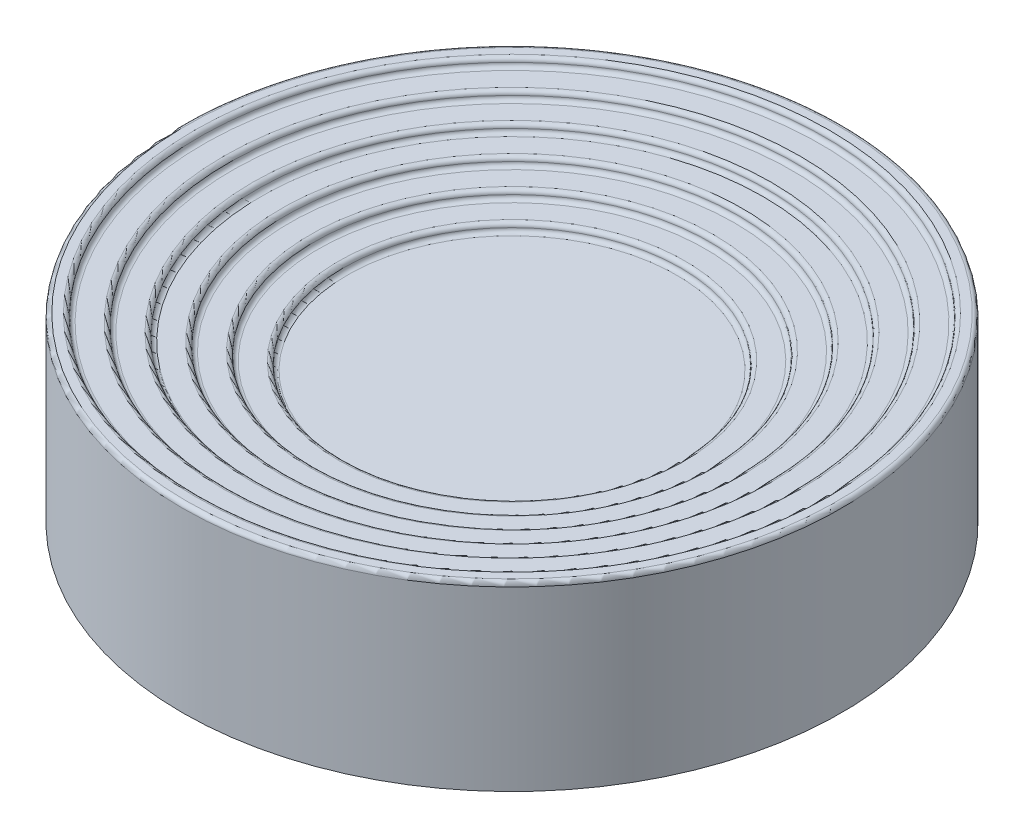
ISO-10303-21;
HEADER;
FILE_DESCRIPTION(('STEP AP214'),'2;1');
FILE_NAME('part.step','',(''),(''),'','','');
FILE_SCHEMA(('AUTOMOTIVE_DESIGN { 1 0 10303 214 1 1 1 1 }'));
ENDSEC;
DATA;
#1=APPLICATION_CONTEXT('core data for automotive mechanical design processes');
#2=APPLICATION_PROTOCOL_DEFINITION('international standard','automotive_design',2000,#1);
#3=PRODUCT_CONTEXT('',#1,'mechanical');
#4=PRODUCT('Part','Part','',(#3));
#5=PRODUCT_RELATED_PRODUCT_CATEGORY('part','',(#4));
#6=PRODUCT_DEFINITION_FORMATION('','',#4);
#7=PRODUCT_DEFINITION_CONTEXT('part definition',#1,'design');
#8=PRODUCT_DEFINITION('design','',#6,#7);
#9=PRODUCT_DEFINITION_SHAPE('','',#8);
#10=(LENGTH_UNIT() NAMED_UNIT(*) SI_UNIT(.MILLI.,.METRE.));
#11=(NAMED_UNIT(*) PLANE_ANGLE_UNIT() SI_UNIT($,.RADIAN.));
#12=(NAMED_UNIT(*) SI_UNIT($,.STERADIAN.) SOLID_ANGLE_UNIT());
#13=UNCERTAINTY_MEASURE_WITH_UNIT(LENGTH_MEASURE(1.E-05),#10,'distance_accuracy_value','');
#14=(GEOMETRIC_REPRESENTATION_CONTEXT(3) GLOBAL_UNCERTAINTY_ASSIGNED_CONTEXT((#13)) GLOBAL_UNIT_ASSIGNED_CONTEXT((#10,
#11,#12)) REPRESENTATION_CONTEXT('',''));
#15=CARTESIAN_POINT('',(0.,0.,0.));
#16=DIRECTION('',(0.,0.,1.));
#17=DIRECTION('',(1.,0.,0.));
#18=AXIS2_PLACEMENT_3D('',#15,#16,#17);
#19=CARTESIAN_POINT('',(0.,32.,0.));
#20=DIRECTION('',(0.,1.,0.));
#21=DIRECTION('',(0.,0.,1.));
#22=AXIS2_PLACEMENT_3D('',#19,#20,#21);
#23=PLANE('',#22);
#24=CARTESIAN_POINT('',(0.,32.,0.));
#25=DIRECTION('',(0.,1.,0.));
#26=DIRECTION('',(0.,0.,1.));
#27=AXIS2_PLACEMENT_3D('',#24,#25,#26);
#28=CIRCLE('',#27,40.);
#29=CARTESIAN_POINT('',(0.,32.,40.));
#30=VERTEX_POINT('',#29);
#31=EDGE_CURVE('E100',#30,#30,#28,.T.);
#32=ORIENTED_EDGE('',*,*,#31,.T.);
#33=EDGE_LOOP('',(#32));
#34=FACE_BOUND('',#33,.T.);
#35=ADVANCED_FACE('F42',(#34),#23,.T.);
#36=CARTESIAN_POINT('',(41.,34.,0.));
#37=DIRECTION('',(0.,1.,0.));
#38=DIRECTION('',(0.,0.,1.));
#39=AXIS2_PLACEMENT_3D('',#36,#37,#38);
#40=PLANE('',#39);
#41=CARTESIAN_POINT('',(0.,34.,0.));
#42=DIRECTION('',(0.,1.,0.));
#43=DIRECTION('',(0.,0.,1.));
#44=AXIS2_PLACEMENT_3D('',#41,#42,#43);
#45=CIRCLE('',#44,42.);
#46=CARTESIAN_POINT('',(0.,34.,42.));
#47=VERTEX_POINT('',#46);
#48=EDGE_CURVE('E108',#47,#47,#45,.F.);
#49=ORIENTED_EDGE('',*,*,#48,.T.);
#50=EDGE_LOOP('',(#49));
#51=FACE_BOUND('',#50,.T.);
#52=CARTESIAN_POINT('',(0.,34.,0.));
#53=DIRECTION('',(0.,1.,0.));
#54=DIRECTION('',(0.,0.,1.));
#55=AXIS2_PLACEMENT_3D('',#52,#53,#54);
#56=CIRCLE('',#55,47.);
#57=CARTESIAN_POINT('',(0.,34.,47.));
#58=VERTEX_POINT('',#57);
#59=EDGE_CURVE('E104',#58,#58,#56,.T.);
#60=ORIENTED_EDGE('',*,*,#59,.T.);
#61=EDGE_LOOP('',(#60));
#62=FACE_BOUND('',#61,.T.);
#63=ADVANCED_FACE('F165',(#51,#62),#40,.T.);
#64=CARTESIAN_POINT('',(48.,36.,0.));
#65=DIRECTION('',(0.,1.,0.));
#66=DIRECTION('',(0.,0.,1.));
#67=AXIS2_PLACEMENT_3D('',#64,#65,#66);
#68=PLANE('',#67);
#69=CARTESIAN_POINT('',(0.,36.,0.));
#70=DIRECTION('',(0.,1.,0.));
#71=DIRECTION('',(0.,0.,1.));
#72=AXIS2_PLACEMENT_3D('',#69,#70,#71);
#73=CIRCLE('',#72,49.);
#74=CARTESIAN_POINT('',(0.,36.,49.));
#75=VERTEX_POINT('',#74);
#76=EDGE_CURVE('E116',#75,#75,#73,.F.);
#77=ORIENTED_EDGE('',*,*,#76,.T.);
#78=EDGE_LOOP('',(#77));
#79=FACE_BOUND('',#78,.T.);
#80=CARTESIAN_POINT('',(0.,36.,0.));
#81=DIRECTION('',(0.,1.,0.));
#82=DIRECTION('',(0.,0.,1.));
#83=AXIS2_PLACEMENT_3D('',#80,#81,#82);
#84=CIRCLE('',#83,54.);
#85=CARTESIAN_POINT('',(0.,36.,54.));
#86=VERTEX_POINT('',#85);
#87=EDGE_CURVE('E112',#86,#86,#84,.T.);
#88=ORIENTED_EDGE('',*,*,#87,.T.);
#89=EDGE_LOOP('',(#88));
#90=FACE_BOUND('',#89,.T.);
#91=ADVANCED_FACE('F171',(#79,#90),#68,.T.);
#92=CARTESIAN_POINT('',(55.,38.,0.));
#93=DIRECTION('',(0.,1.,0.));
#94=DIRECTION('',(0.,0.,1.));
#95=AXIS2_PLACEMENT_3D('',#92,#93,#94);
#96=PLANE('',#95);
#97=CARTESIAN_POINT('',(0.,38.,0.));
#98=DIRECTION('',(0.,1.,0.));
#99=DIRECTION('',(0.,0.,1.));
#100=AXIS2_PLACEMENT_3D('',#97,#98,#99);
#101=CIRCLE('',#100,56.);
#102=CARTESIAN_POINT('',(0.,38.,56.));
#103=VERTEX_POINT('',#102);
#104=EDGE_CURVE('E124',#103,#103,#101,.F.);
#105=ORIENTED_EDGE('',*,*,#104,.T.);
#106=EDGE_LOOP('',(#105));
#107=FACE_BOUND('',#106,.T.);
#108=CARTESIAN_POINT('',(0.,38.,0.));
#109=DIRECTION('',(0.,1.,0.));
#110=DIRECTION('',(0.,0.,1.));
#111=AXIS2_PLACEMENT_3D('',#108,#109,#110);
#112=CIRCLE('',#111,61.);
#113=CARTESIAN_POINT('',(0.,38.,61.));
#114=VERTEX_POINT('',#113);
#115=EDGE_CURVE('E120',#114,#114,#112,.T.);
#116=ORIENTED_EDGE('',*,*,#115,.T.);
#117=EDGE_LOOP('',(#116));
#118=FACE_BOUND('',#117,.T.);
#119=ADVANCED_FACE('F239',(#107,#118),#96,.T.);
#120=CARTESIAN_POINT('',(62.,40.,0.));
#121=DIRECTION('',(0.,1.,0.));
#122=DIRECTION('',(0.,0.,1.));
#123=AXIS2_PLACEMENT_3D('',#120,#121,#122);
#124=PLANE('',#123);
#125=CARTESIAN_POINT('',(0.,40.,0.));
#126=DIRECTION('',(0.,1.,0.));
#127=DIRECTION('',(0.,0.,1.));
#128=AXIS2_PLACEMENT_3D('',#125,#126,#127);
#129=CIRCLE('',#128,63.);
#130=CARTESIAN_POINT('',(0.,40.,63.));
#131=VERTEX_POINT('',#130);
#132=EDGE_CURVE('E132',#131,#131,#129,.F.);
#133=ORIENTED_EDGE('',*,*,#132,.T.);
#134=EDGE_LOOP('',(#133));
#135=FACE_BOUND('',#134,.T.);
#136=CARTESIAN_POINT('',(0.,40.,0.));
#137=DIRECTION('',(0.,1.,0.));
#138=DIRECTION('',(0.,0.,1.));
#139=AXIS2_PLACEMENT_3D('',#136,#137,#138);
#140=CIRCLE('',#139,68.);
#141=CARTESIAN_POINT('',(0.,40.,68.));
#142=VERTEX_POINT('',#141);
#143=EDGE_CURVE('E128',#142,#142,#140,.T.);
#144=ORIENTED_EDGE('',*,*,#143,.T.);
#145=EDGE_LOOP('',(#144));
#146=FACE_BOUND('',#145,.T.);
#147=ADVANCED_FACE('F232',(#135,#146),#124,.T.);
#148=CARTESIAN_POINT('',(69.,42.,0.));
#149=DIRECTION('',(0.,1.,0.));
#150=DIRECTION('',(0.,0.,1.));
#151=AXIS2_PLACEMENT_3D('',#148,#149,#150);
#152=PLANE('',#151);
#153=CARTESIAN_POINT('',(0.,42.,0.));
#154=DIRECTION('',(0.,1.,0.));
#155=DIRECTION('',(0.,0.,1.));
#156=AXIS2_PLACEMENT_3D('',#153,#154,#155);
#157=CIRCLE('',#156,70.);
#158=CARTESIAN_POINT('',(0.,42.,70.));
#159=VERTEX_POINT('',#158);
#160=EDGE_CURVE('E140',#159,#159,#157,.F.);
#161=ORIENTED_EDGE('',*,*,#160,.T.);
#162=EDGE_LOOP('',(#161));
#163=FACE_BOUND('',#162,.T.);
#164=CARTESIAN_POINT('',(0.,42.,0.));
#165=DIRECTION('',(0.,1.,0.));
#166=DIRECTION('',(0.,0.,1.));
#167=AXIS2_PLACEMENT_3D('',#164,#165,#166);
#168=CIRCLE('',#167,75.);
#169=CARTESIAN_POINT('',(0.,42.,75.));
#170=VERTEX_POINT('',#169);
#171=EDGE_CURVE('E136',#170,#170,#168,.T.);
#172=ORIENTED_EDGE('',*,*,#171,.T.);
#173=EDGE_LOOP('',(#172));
#174=FACE_BOUND('',#173,.T.);
#175=ADVANCED_FACE('F225',(#163,#174),#152,.T.);
#176=CARTESIAN_POINT('',(80.,44.,0.));
#177=DIRECTION('',(0.,1.,0.));
#178=DIRECTION('',(0.,0.,1.));
#179=AXIS2_PLACEMENT_3D('',#176,#177,#178);
#180=PLANE('',#179);
#181=CARTESIAN_POINT('',(0.,44.,0.));
#182=DIRECTION('',(0.,1.,0.));
#183=DIRECTION('',(0.,0.,1.));
#184=AXIS2_PLACEMENT_3D('',#181,#182,#183);
#185=CIRCLE('',#184,77.);
#186=CARTESIAN_POINT('',(0.,44.,77.));
#187=VERTEX_POINT('',#186);
#188=EDGE_CURVE('E51',#187,#187,#185,.F.);
#189=ORIENTED_EDGE('',*,*,#188,.T.);
#190=EDGE_LOOP('',(#189));
#191=FACE_BOUND('',#190,.T.);
#192=CARTESIAN_POINT('',(0.,44.,0.));
#193=DIRECTION('',(0.,1.,0.));
#194=DIRECTION('',(0.,0.,1.));
#195=AXIS2_PLACEMENT_3D('',#192,#193,#194);
#196=CIRCLE('',#195,79.);
#197=CARTESIAN_POINT('',(0.,44.,79.));
#198=VERTEX_POINT('',#197);
#199=EDGE_CURVE('E57',#198,#198,#196,.T.);
#200=ORIENTED_EDGE('',*,*,#199,.T.);
#201=EDGE_LOOP('',(#200));
#202=FACE_BOUND('',#201,.T.);
#203=ADVANCED_FACE('F147',(#191,#202),#180,.T.);
#204=CARTESIAN_POINT('',(0.,0.,0.));
#205=DIRECTION('',(0.,-1.,0.));
#206=DIRECTION('',(0.,0.,-1.));
#207=AXIS2_PLACEMENT_3D('',#204,#205,#206);
#208=CYLINDRICAL_SURFACE('',#207,80.);
#209=CARTESIAN_POINT('',(0.,43.,0.));
#210=DIRECTION('',(0.,1.,0.));
#211=DIRECTION('',(0.,0.,1.));
#212=AXIS2_PLACEMENT_3D('',#209,#210,#211);
#213=CIRCLE('',#212,80.);
#214=CARTESIAN_POINT('',(0.,43.,80.));
#215=VERTEX_POINT('',#214);
#216=EDGE_CURVE('E10',#215,#215,#213,.F.);
#217=ORIENTED_EDGE('',*,*,#216,.T.);
#218=EDGE_LOOP('',(#217));
#219=FACE_BOUND('',#218,.T.);
#220=CARTESIAN_POINT('',(0.,0.,0.));
#221=DIRECTION('',(0.,-1.,0.));
#222=DIRECTION('',(0.,0.,-1.));
#223=AXIS2_PLACEMENT_3D('',#220,#221,#222);
#224=CIRCLE('',#223,80.);
#225=CARTESIAN_POINT('',(0.,0.,-80.));
#226=VERTEX_POINT('',#225);
#227=EDGE_CURVE('E65',#226,#226,#224,.T.);
#228=ORIENTED_EDGE('',*,*,#227,.F.);
#229=EDGE_LOOP('',(#228));
#230=FACE_BOUND('',#229,.T.);
#231=ADVANCED_FACE('F224',(#219,#230),#208,.T.);
#232=CARTESIAN_POINT('',(0.,0.,0.));
#233=DIRECTION('',(0.,-1.,0.));
#234=DIRECTION('',(0.,0.,-1.));
#235=AXIS2_PLACEMENT_3D('',#232,#233,#234);
#236=PLANE('',#235);
#237=CARTESIAN_POINT('',(0.,0.,0.));
#238=DIRECTION('',(0.,-1.,0.));
#239=DIRECTION('',(0.,0.,-1.));
#240=AXIS2_PLACEMENT_3D('',#237,#238,#239);
#241=CIRCLE('',#240,72.);
#242=CARTESIAN_POINT('',(0.,0.,-72.));
#243=VERTEX_POINT('',#242);
#244=EDGE_CURVE('E89',#243,#243,#241,.T.);
#245=ORIENTED_EDGE('',*,*,#244,.F.);
#246=EDGE_LOOP('',(#245));
#247=FACE_BOUND('',#246,.T.);
#248=ORIENTED_EDGE('',*,*,#227,.T.);
#249=EDGE_LOOP('',(#248));
#250=FACE_BOUND('',#249,.T.);
#251=ADVANCED_FACE('F184',(#247,#250),#236,.T.);
#252=CARTESIAN_POINT('',(0.,33.,0.));
#253=DIRECTION('',(0.,1.,0.));
#254=DIRECTION('',(0.,0.,1.));
#255=AXIS2_PLACEMENT_3D('',#252,#253,#254);
#256=TOROIDAL_SURFACE('',#255,42.,1.);
#257=ORIENTED_EDGE('',*,*,#48,.F.);
#258=EDGE_LOOP('',(#257));
#259=FACE_BOUND('',#258,.T.);
#260=CARTESIAN_POINT('',(0.,33.,0.));
#261=DIRECTION('',(0.,1.,0.));
#262=DIRECTION('',(0.,0.,1.));
#263=AXIS2_PLACEMENT_3D('',#260,#261,#262);
#264=CIRCLE('',#263,41.);
#265=CARTESIAN_POINT('',(0.,33.,41.));
#266=VERTEX_POINT('',#265);
#267=EDGE_CURVE('E61',#266,#266,#264,.T.);
#268=ORIENTED_EDGE('',*,*,#267,.F.);
#269=EDGE_LOOP('',(#268));
#270=FACE_BOUND('',#269,.T.);
#271=ADVANCED_FACE('F180',(#259,#270),#256,.T.);
#272=CARTESIAN_POINT('',(0.,33.,0.));
#273=DIRECTION('',(0.,1.,0.));
#274=DIRECTION('',(0.,0.,1.));
#275=AXIS2_PLACEMENT_3D('',#272,#273,#274);
#276=TOROIDAL_SURFACE('',#275,40.,1.);
#277=ORIENTED_EDGE('',*,*,#31,.F.);
#278=EDGE_LOOP('',(#277));
#279=FACE_BOUND('',#278,.T.);
#280=ORIENTED_EDGE('',*,*,#267,.T.);
#281=EDGE_LOOP('',(#280));
#282=FACE_BOUND('',#281,.T.);
#283=ADVANCED_FACE('F176',(#279,#282),#276,.F.);
#284=CARTESIAN_POINT('',(0.,35.,0.));
#285=DIRECTION('',(0.,1.,0.));
#286=DIRECTION('',(0.,0.,1.));
#287=AXIS2_PLACEMENT_3D('',#284,#285,#286);
#288=TOROIDAL_SURFACE('',#287,49.,1.);
#289=ORIENTED_EDGE('',*,*,#76,.F.);
#290=EDGE_LOOP('',(#289));
#291=FACE_BOUND('',#290,.T.);
#292=CARTESIAN_POINT('',(0.,35.,0.));
#293=DIRECTION('',(0.,1.,0.));
#294=DIRECTION('',(0.,0.,1.));
#295=AXIS2_PLACEMENT_3D('',#292,#293,#294);
#296=CIRCLE('',#295,48.);
#297=CARTESIAN_POINT('',(0.,35.,48.));
#298=VERTEX_POINT('',#297);
#299=EDGE_CURVE('E66',#298,#298,#296,.T.);
#300=ORIENTED_EDGE('',*,*,#299,.F.);
#301=EDGE_LOOP('',(#300));
#302=FACE_BOUND('',#301,.T.);
#303=ADVANCED_FACE('F179',(#291,#302),#288,.T.);
#304=CARTESIAN_POINT('',(0.,35.,0.));
#305=DIRECTION('',(0.,1.,0.));
#306=DIRECTION('',(0.,0.,1.));
#307=AXIS2_PLACEMENT_3D('',#304,#305,#306);
#308=TOROIDAL_SURFACE('',#307,47.,1.);
#309=ORIENTED_EDGE('',*,*,#59,.F.);
#310=EDGE_LOOP('',(#309));
#311=FACE_BOUND('',#310,.T.);
#312=ORIENTED_EDGE('',*,*,#299,.T.);
#313=EDGE_LOOP('',(#312));
#314=FACE_BOUND('',#313,.T.);
#315=ADVANCED_FACE('F186',(#311,#314),#308,.F.);
#316=CARTESIAN_POINT('',(0.,37.,0.));
#317=DIRECTION('',(0.,1.,0.));
#318=DIRECTION('',(0.,0.,1.));
#319=AXIS2_PLACEMENT_3D('',#316,#317,#318);
#320=TOROIDAL_SURFACE('',#319,56.,1.);
#321=ORIENTED_EDGE('',*,*,#104,.F.);
#322=EDGE_LOOP('',(#321));
#323=FACE_BOUND('',#322,.T.);
#324=CARTESIAN_POINT('',(0.,37.,0.));
#325=DIRECTION('',(0.,1.,0.));
#326=DIRECTION('',(0.,0.,1.));
#327=AXIS2_PLACEMENT_3D('',#324,#325,#326);
#328=CIRCLE('',#327,55.);
#329=CARTESIAN_POINT('',(0.,37.,55.));
#330=VERTEX_POINT('',#329);
#331=EDGE_CURVE('E70',#330,#330,#328,.T.);
#332=ORIENTED_EDGE('',*,*,#331,.F.);
#333=EDGE_LOOP('',(#332));
#334=FACE_BOUND('',#333,.T.);
#335=ADVANCED_FACE('F189',(#323,#334),#320,.T.);
#336=CARTESIAN_POINT('',(0.,37.,0.));
#337=DIRECTION('',(0.,1.,0.));
#338=DIRECTION('',(0.,0.,1.));
#339=AXIS2_PLACEMENT_3D('',#336,#337,#338);
#340=TOROIDAL_SURFACE('',#339,54.,1.);
#341=ORIENTED_EDGE('',*,*,#87,.F.);
#342=EDGE_LOOP('',(#341));
#343=FACE_BOUND('',#342,.T.);
#344=ORIENTED_EDGE('',*,*,#331,.T.);
#345=EDGE_LOOP('',(#344));
#346=FACE_BOUND('',#345,.T.);
#347=ADVANCED_FACE('F194',(#343,#346),#340,.F.);
#348=CARTESIAN_POINT('',(0.,39.,0.));
#349=DIRECTION('',(0.,1.,0.));
#350=DIRECTION('',(0.,0.,1.));
#351=AXIS2_PLACEMENT_3D('',#348,#349,#350);
#352=TOROIDAL_SURFACE('',#351,63.,1.);
#353=ORIENTED_EDGE('',*,*,#132,.F.);
#354=EDGE_LOOP('',(#353));
#355=FACE_BOUND('',#354,.T.);
#356=CARTESIAN_POINT('',(0.,39.,0.));
#357=DIRECTION('',(0.,1.,0.));
#358=DIRECTION('',(0.,0.,1.));
#359=AXIS2_PLACEMENT_3D('',#356,#357,#358);
#360=CIRCLE('',#359,62.);
#361=CARTESIAN_POINT('',(0.,39.,62.));
#362=VERTEX_POINT('',#361);
#363=EDGE_CURVE('E74',#362,#362,#360,.T.);
#364=ORIENTED_EDGE('',*,*,#363,.F.);
#365=EDGE_LOOP('',(#364));
#366=FACE_BOUND('',#365,.T.);
#367=ADVANCED_FACE('F197',(#355,#366),#352,.T.);
#368=CARTESIAN_POINT('',(0.,39.,0.));
#369=DIRECTION('',(0.,1.,0.));
#370=DIRECTION('',(0.,0.,1.));
#371=AXIS2_PLACEMENT_3D('',#368,#369,#370);
#372=TOROIDAL_SURFACE('',#371,61.,1.);
#373=ORIENTED_EDGE('',*,*,#115,.F.);
#374=EDGE_LOOP('',(#373));
#375=FACE_BOUND('',#374,.T.);
#376=ORIENTED_EDGE('',*,*,#363,.T.);
#377=EDGE_LOOP('',(#376));
#378=FACE_BOUND('',#377,.T.);
#379=ADVANCED_FACE('F202',(#375,#378),#372,.F.);
#380=CARTESIAN_POINT('',(0.,41.,0.));
#381=DIRECTION('',(0.,1.,0.));
#382=DIRECTION('',(0.,0.,1.));
#383=AXIS2_PLACEMENT_3D('',#380,#381,#382);
#384=TOROIDAL_SURFACE('',#383,70.,1.);
#385=ORIENTED_EDGE('',*,*,#160,.F.);
#386=EDGE_LOOP('',(#385));
#387=FACE_BOUND('',#386,.T.);
#388=CARTESIAN_POINT('',(0.,41.,0.));
#389=DIRECTION('',(0.,1.,0.));
#390=DIRECTION('',(0.,0.,1.));
#391=AXIS2_PLACEMENT_3D('',#388,#389,#390);
#392=CIRCLE('',#391,69.);
#393=CARTESIAN_POINT('',(0.,41.,69.));
#394=VERTEX_POINT('',#393);
#395=EDGE_CURVE('E77',#394,#394,#392,.T.);
#396=ORIENTED_EDGE('',*,*,#395,.F.);
#397=EDGE_LOOP('',(#396));
#398=FACE_BOUND('',#397,.T.);
#399=ADVANCED_FACE('F205',(#387,#398),#384,.T.);
#400=CARTESIAN_POINT('',(0.,41.,0.));
#401=DIRECTION('',(0.,1.,0.));
#402=DIRECTION('',(0.,0.,1.));
#403=AXIS2_PLACEMENT_3D('',#400,#401,#402);
#404=TOROIDAL_SURFACE('',#403,68.,1.);
#405=ORIENTED_EDGE('',*,*,#143,.F.);
#406=EDGE_LOOP('',(#405));
#407=FACE_BOUND('',#406,.T.);
#408=ORIENTED_EDGE('',*,*,#395,.T.);
#409=EDGE_LOOP('',(#408));
#410=FACE_BOUND('',#409,.T.);
#411=ADVANCED_FACE('F210',(#407,#410),#404,.F.);
#412=CARTESIAN_POINT('',(0.,43.,0.));
#413=DIRECTION('',(0.,1.,0.));
#414=DIRECTION('',(0.,0.,1.));
#415=AXIS2_PLACEMENT_3D('',#412,#413,#414);
#416=TOROIDAL_SURFACE('',#415,77.,1.);
#417=ORIENTED_EDGE('',*,*,#188,.F.);
#418=EDGE_LOOP('',(#417));
#419=FACE_BOUND('',#418,.T.);
#420=CARTESIAN_POINT('',(0.,43.,0.));
#421=DIRECTION('',(0.,1.,0.));
#422=DIRECTION('',(0.,0.,1.));
#423=AXIS2_PLACEMENT_3D('',#420,#421,#422);
#424=CIRCLE('',#423,76.);
#425=CARTESIAN_POINT('',(0.,43.,76.));
#426=VERTEX_POINT('',#425);
#427=EDGE_CURVE('E46',#426,#426,#424,.T.);
#428=ORIENTED_EDGE('',*,*,#427,.F.);
#429=EDGE_LOOP('',(#428));
#430=FACE_BOUND('',#429,.T.);
#431=ADVANCED_FACE('F161',(#419,#430),#416,.T.);
#432=CARTESIAN_POINT('',(0.,43.,0.));
#433=DIRECTION('',(0.,1.,0.));
#434=DIRECTION('',(0.,0.,1.));
#435=AXIS2_PLACEMENT_3D('',#432,#433,#434);
#436=TOROIDAL_SURFACE('',#435,75.,1.);
#437=ORIENTED_EDGE('',*,*,#171,.F.);
#438=EDGE_LOOP('',(#437));
#439=FACE_BOUND('',#438,.T.);
#440=ORIENTED_EDGE('',*,*,#427,.T.);
#441=EDGE_LOOP('',(#440));
#442=FACE_BOUND('',#441,.T.);
#443=ADVANCED_FACE('F152',(#439,#442),#436,.F.);
#444=CARTESIAN_POINT('',(0.,43.,0.));
#445=DIRECTION('',(0.,1.,0.));
#446=DIRECTION('',(0.,0.,1.));
#447=AXIS2_PLACEMENT_3D('',#444,#445,#446);
#448=TOROIDAL_SURFACE('',#447,79.,1.);
#449=ORIENTED_EDGE('',*,*,#199,.F.);
#450=EDGE_LOOP('',(#449));
#451=FACE_BOUND('',#450,.T.);
#452=ORIENTED_EDGE('',*,*,#216,.F.);
#453=EDGE_LOOP('',(#452));
#454=FACE_BOUND('',#453,.T.);
#455=ADVANCED_FACE('F44',(#451,#454),#448,.T.);
#456=CARTESIAN_POINT('',(0.,27.,0.));
#457=DIRECTION('',(0.,-1.,0.));
#458=DIRECTION('',(0.,0.,-1.));
#459=AXIS2_PLACEMENT_3D('',#456,#457,#458);
#460=CYLINDRICAL_SURFACE('',#459,72.);
#461=CARTESIAN_POINT('',(0.,27.,0.));
#462=DIRECTION('',(0.,-1.,0.));
#463=DIRECTION('',(0.,0.,-1.));
#464=AXIS2_PLACEMENT_3D('',#461,#462,#463);
#465=CIRCLE('',#464,72.);
#466=CARTESIAN_POINT('',(0.,27.,-72.));
#467=VERTEX_POINT('',#466);
#468=EDGE_CURVE('E84',#467,#467,#465,.T.);
#469=ORIENTED_EDGE('',*,*,#468,.F.);
#470=EDGE_LOOP('',(#469));
#471=FACE_BOUND('',#470,.T.);
#472=ORIENTED_EDGE('',*,*,#244,.T.);
#473=EDGE_LOOP('',(#472));
#474=FACE_BOUND('',#473,.T.);
#475=ADVANCED_FACE('F151',(#471,#474),#460,.F.);
#476=CARTESIAN_POINT('',(0.,27.,0.));
#477=DIRECTION('',(0.,-1.,0.));
#478=DIRECTION('',(0.,0.,-1.));
#479=AXIS2_PLACEMENT_3D('',#476,#477,#478);
#480=PLANE('',#479);
#481=ORIENTED_EDGE('',*,*,#468,.T.);
#482=EDGE_LOOP('',(#481));
#483=FACE_BOUND('',#482,.T.);
#484=ADVANCED_FACE('F158',(#483),#480,.T.);
#485=CLOSED_SHELL('',(#35,#63,#91,#119,#147,#175,#203,#231,#251,#271,#283,#303,#315,#335,#347,
#367,#379,#399,#411,#431,#443,#455,#475,#484));
#486=MANIFOLD_SOLID_BREP('B2',#485);
#487=ADVANCED_BREP_SHAPE_REPRESENTATION('',(#18,#486),#14);
#488=SHAPE_DEFINITION_REPRESENTATION(#9,#487);
ENDSEC;
END-ISO-10303-21;
